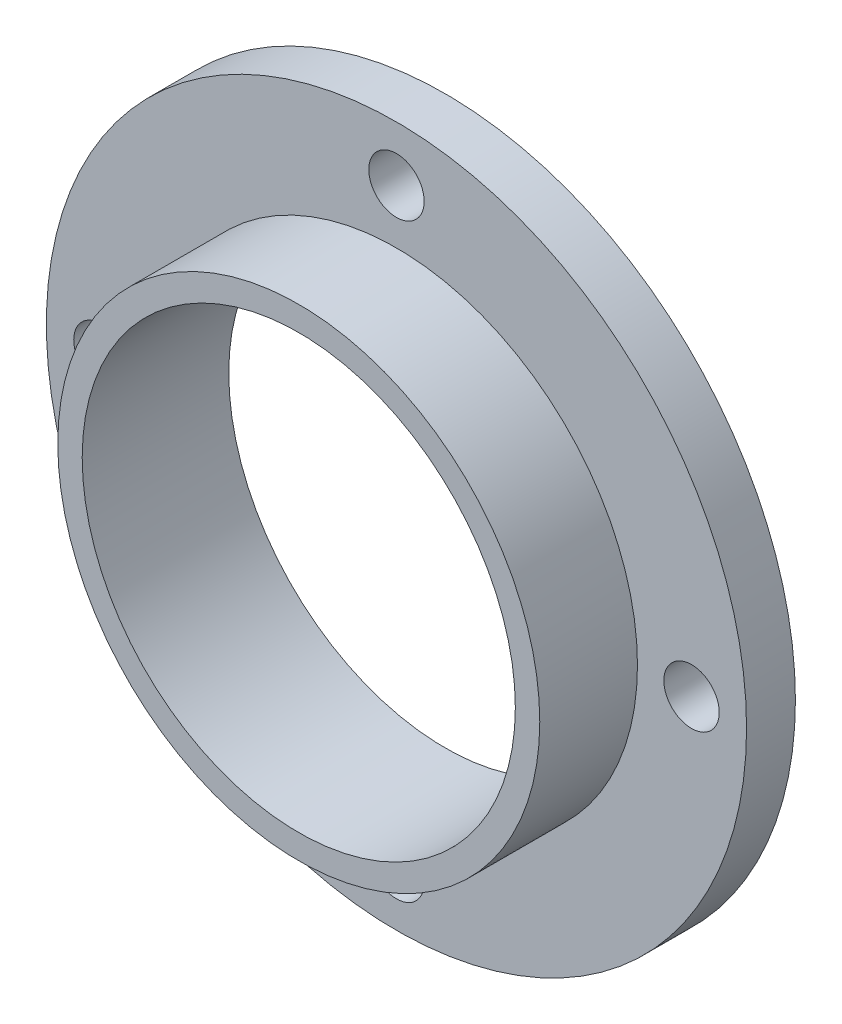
from build123d import *

# Parameters (mm, degrees)
ESQUISSE1_R             = 21.5
ESQUISSE1_R_2           = 13.3
ESQUISSE1_R_3           = 1.7
EXTRUSION1_DEPTH        = 9
ESQUISSE2_R             = 22.420417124
ESQUISSE2_R_2           = 14.8
ENL_V_MAT_EXTRU_1_DEPTH = 6


with BuildPart() as part:
    # Esquisse1 → Extrusion1 (new body)
    with BuildSketch(Plane.XY):
        Circle(ESQUISSE1_R)
        Circle(ESQUISSE1_R_2, mode=Mode.SUBTRACT)
        with Locations((0, 18.11989267)):
            Circle(ESQUISSE1_R_3, mode=Mode.SUBTRACT)
        with Locations(Location((0, -18.11989267, 0), (0, 0, 180))):
            Circle(ESQUISSE1_R_3, mode=Mode.SUBTRACT)
        with Locations((18.11989267, 0)):
            Circle(ESQUISSE1_R_3, mode=Mode.SUBTRACT)
        with Locations(Location((-18.11989267, 0, 0), (0, 0, 180))):
            Circle(ESQUISSE1_R_3, mode=Mode.SUBTRACT)
    extrude(amount=EXTRUSION1_DEPTH)

    # Esquisse2 → Enl_v. mat.-Extru.1 (cut)
    with BuildSketch(Plane.XY.offset(9)):
        Circle(ESQUISSE2_R)
        Circle(ESQUISSE2_R_2, mode=Mode.SUBTRACT)
    extrude(amount=-ENL_V_MAT_EXTRU_1_DEPTH, mode=Mode.SUBTRACT)


solid = part.part
